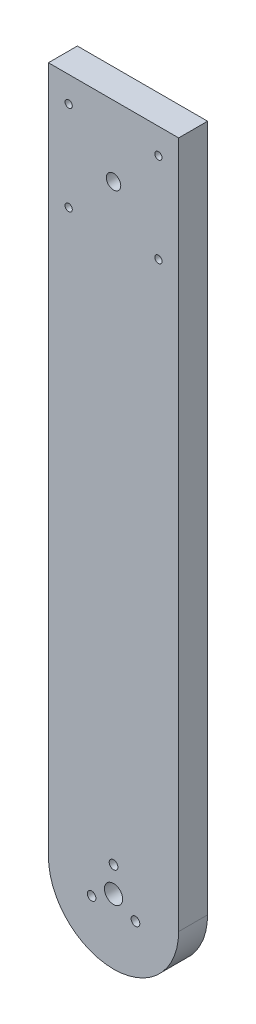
ISO-10303-21;
HEADER;
FILE_DESCRIPTION(('STEP AP214'),'2;1');
FILE_NAME('part.step','',(''),(''),'','','');
FILE_SCHEMA(('AUTOMOTIVE_DESIGN { 1 0 10303 214 1 1 1 1 }'));
ENDSEC;
DATA;
#1=APPLICATION_CONTEXT('core data for automotive mechanical design processes');
#2=APPLICATION_PROTOCOL_DEFINITION('international standard','automotive_design',2000,#1);
#3=PRODUCT_CONTEXT('',#1,'mechanical');
#4=PRODUCT('Part','Part','',(#3));
#5=PRODUCT_RELATED_PRODUCT_CATEGORY('part','',(#4));
#6=PRODUCT_DEFINITION_FORMATION('','',#4);
#7=PRODUCT_DEFINITION_CONTEXT('part definition',#1,'design');
#8=PRODUCT_DEFINITION('design','',#6,#7);
#9=PRODUCT_DEFINITION_SHAPE('','',#8);
#10=(LENGTH_UNIT() NAMED_UNIT(*) SI_UNIT(.MILLI.,.METRE.));
#11=(NAMED_UNIT(*) PLANE_ANGLE_UNIT() SI_UNIT($,.RADIAN.));
#12=(NAMED_UNIT(*) SI_UNIT($,.STERADIAN.) SOLID_ANGLE_UNIT());
#13=UNCERTAINTY_MEASURE_WITH_UNIT(LENGTH_MEASURE(1.E-05),#10,'distance_accuracy_value','');
#14=(GEOMETRIC_REPRESENTATION_CONTEXT(3) GLOBAL_UNCERTAINTY_ASSIGNED_CONTEXT((#13)) GLOBAL_UNIT_ASSIGNED_CONTEXT((#10,
#11,#12)) REPRESENTATION_CONTEXT('',''));
#15=CARTESIAN_POINT('',(0.,0.,0.));
#16=DIRECTION('',(0.,0.,1.));
#17=DIRECTION('',(1.,0.,0.));
#18=AXIS2_PLACEMENT_3D('',#15,#16,#17);
#19=CARTESIAN_POINT('',(5.46437894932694E-12,-107.5,10.));
#20=DIRECTION('',(0.,0.,1.));
#21=DIRECTION('',(1.,0.,0.));
#22=AXIS2_PLACEMENT_3D('',#19,#20,#21);
#23=PLANE('',#22);
#24=CARTESIAN_POINT('',(7.57772228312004,-111.875,10.));
#25=DIRECTION('',(0.,0.,1.));
#26=DIRECTION('',(1.,0.,0.));
#27=AXIS2_PLACEMENT_3D('',#24,#25,#26);
#28=CIRCLE('',#27,1.5);
#29=CARTESIAN_POINT('',(9.07772228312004,-111.875,10.));
#30=VERTEX_POINT('',#29);
#31=EDGE_CURVE('E151',#30,#30,#28,.T.);
#32=ORIENTED_EDGE('',*,*,#31,.F.);
#33=EDGE_LOOP('',(#32));
#34=FACE_BOUND('',#33,.T.);
#35=CARTESIAN_POINT('',(5.46437894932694E-12,-98.75,10.));
#36=DIRECTION('',(0.,0.,1.));
#37=DIRECTION('',(1.,0.,0.));
#38=AXIS2_PLACEMENT_3D('',#35,#36,#37);
#39=CIRCLE('',#38,1.5);
#40=CARTESIAN_POINT('',(1.50000000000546,-98.75,10.));
#41=VERTEX_POINT('',#40);
#42=EDGE_CURVE('E139',#41,#41,#39,.T.);
#43=ORIENTED_EDGE('',*,*,#42,.F.);
#44=EDGE_LOOP('',(#43));
#45=FACE_BOUND('',#44,.T.);
#46=CARTESIAN_POINT('',(-15.4999999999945,90.1639203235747,10.));
#47=DIRECTION('',(0.,0.,1.));
#48=DIRECTION('',(-1.,0.,0.));
#49=AXIS2_PLACEMENT_3D('',#46,#47,#48);
#50=CIRCLE('',#49,1.25);
#51=CARTESIAN_POINT('',(-16.7499999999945,90.1639203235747,10.));
#52=VERTEX_POINT('',#51);
#53=EDGE_CURVE('E127',#52,#52,#50,.T.);
#54=ORIENTED_EDGE('',*,*,#53,.F.);
#55=EDGE_LOOP('',(#54));
#56=FACE_BOUND('',#55,.T.);
#57=CARTESIAN_POINT('',(15.5000000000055,121.163920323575,10.));
#58=DIRECTION('',(0.,0.,1.));
#59=DIRECTION('',(-1.,0.,0.));
#60=AXIS2_PLACEMENT_3D('',#57,#58,#59);
#61=CIRCLE('',#60,1.25);
#62=CARTESIAN_POINT('',(14.2500000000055,121.163920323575,10.));
#63=VERTEX_POINT('',#62);
#64=EDGE_CURVE('E115',#63,#63,#61,.T.);
#65=ORIENTED_EDGE('',*,*,#64,.F.);
#66=EDGE_LOOP('',(#65));
#67=FACE_BOUND('',#66,.T.);
#68=DIRECTION('',(0.,-1.,0.));
#69=VECTOR('',#68,1.);
#70=CARTESIAN_POINT('',(-22.5,130.,10.));
#71=LINE('',#70,#69);
#72=CARTESIAN_POINT('',(-22.5,130.,10.));
#73=VERTEX_POINT('',#72);
#74=CARTESIAN_POINT('',(-22.4999999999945,-107.5,10.));
#75=VERTEX_POINT('',#74);
#76=EDGE_CURVE('E85',#73,#75,#71,.T.);
#77=ORIENTED_EDGE('',*,*,#76,.T.);
#78=CARTESIAN_POINT('',(5.46437894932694E-12,-107.5,10.));
#79=DIRECTION('',(0.,0.,1.));
#80=DIRECTION('',(1.,0.,0.));
#81=AXIS2_PLACEMENT_3D('',#78,#79,#80);
#82=CIRCLE('',#81,22.5);
#83=CARTESIAN_POINT('',(22.5,-107.5,10.));
#84=VERTEX_POINT('',#83);
#85=EDGE_CURVE('E80',#75,#84,#82,.T.);
#86=ORIENTED_EDGE('',*,*,#85,.T.);
#87=DIRECTION('',(0.,1.,0.));
#88=VECTOR('',#87,1.);
#89=CARTESIAN_POINT('',(22.5,130.,10.));
#90=LINE('',#89,#88);
#91=CARTESIAN_POINT('',(22.5,130.,10.));
#92=VERTEX_POINT('',#91);
#93=EDGE_CURVE('E83',#84,#92,#90,.T.);
#94=ORIENTED_EDGE('',*,*,#93,.T.);
#95=DIRECTION('',(-1.,0.,0.));
#96=VECTOR('',#95,1.);
#97=CARTESIAN_POINT('',(-22.5,130.,10.));
#98=LINE('',#97,#96);
#99=EDGE_CURVE('E50',#92,#73,#98,.T.);
#100=ORIENTED_EDGE('',*,*,#99,.T.);
#101=EDGE_LOOP('',(#77,#86,#94,#100));
#102=FACE_BOUND('',#101,.T.);
#103=CARTESIAN_POINT('',(-15.4999999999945,121.163920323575,10.));
#104=DIRECTION('',(0.,0.,1.));
#105=DIRECTION('',(1.,0.,0.));
#106=AXIS2_PLACEMENT_3D('',#103,#104,#105);
#107=CIRCLE('',#106,1.25);
#108=CARTESIAN_POINT('',(-14.2499999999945,121.163920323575,10.));
#109=VERTEX_POINT('',#108);
#110=EDGE_CURVE('E100',#109,#109,#107,.T.);
#111=ORIENTED_EDGE('',*,*,#110,.F.);
#112=EDGE_LOOP('',(#111));
#113=FACE_BOUND('',#112,.T.);
#114=CARTESIAN_POINT('',(15.5000000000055,90.1639203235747,10.));
#115=DIRECTION('',(0.,0.,1.));
#116=DIRECTION('',(1.,0.,0.));
#117=AXIS2_PLACEMENT_3D('',#114,#115,#116);
#118=CIRCLE('',#117,1.25);
#119=CARTESIAN_POINT('',(16.7500000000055,90.1639203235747,10.));
#120=VERTEX_POINT('',#119);
#121=EDGE_CURVE('E121',#120,#120,#118,.T.);
#122=ORIENTED_EDGE('',*,*,#121,.F.);
#123=EDGE_LOOP('',(#122));
#124=FACE_BOUND('',#123,.T.);
#125=CARTESIAN_POINT('',(5.4678483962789E-12,105.663920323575,10.));
#126=DIRECTION('',(0.,0.,1.));
#127=DIRECTION('',(1.,0.,0.));
#128=AXIS2_PLACEMENT_3D('',#125,#126,#127);
#129=CIRCLE('',#128,2.5);
#130=CARTESIAN_POINT('',(2.50000000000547,105.663920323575,10.));
#131=VERTEX_POINT('',#130);
#132=EDGE_CURVE('E133',#131,#131,#129,.T.);
#133=ORIENTED_EDGE('',*,*,#132,.F.);
#134=EDGE_LOOP('',(#133));
#135=FACE_BOUND('',#134,.T.);
#136=CARTESIAN_POINT('',(5.46437894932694E-12,-107.5,10.));
#137=DIRECTION('',(0.,0.,1.));
#138=DIRECTION('',(1.,0.,0.));
#139=AXIS2_PLACEMENT_3D('',#136,#137,#138);
#140=CIRCLE('',#139,3.15);
#141=CARTESIAN_POINT('',(3.15000000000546,-107.5,10.));
#142=VERTEX_POINT('',#141);
#143=EDGE_CURVE('E145',#142,#142,#140,.T.);
#144=ORIENTED_EDGE('',*,*,#143,.F.);
#145=EDGE_LOOP('',(#144));
#146=FACE_BOUND('',#145,.T.);
#147=CARTESIAN_POINT('',(-7.5777222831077,-111.875,10.));
#148=DIRECTION('',(0.,0.,1.));
#149=DIRECTION('',(1.,0.,0.));
#150=AXIS2_PLACEMENT_3D('',#147,#148,#149);
#151=CIRCLE('',#150,1.49999999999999);
#152=CARTESIAN_POINT('',(-6.07772228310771,-111.875,10.));
#153=VERTEX_POINT('',#152);
#154=EDGE_CURVE('E157',#153,#153,#151,.T.);
#155=ORIENTED_EDGE('',*,*,#154,.F.);
#156=EDGE_LOOP('',(#155));
#157=FACE_BOUND('',#156,.T.);
#158=ADVANCED_FACE('F33',(#34,#45,#56,#67,#102,#113,#124,#135,#146,#157),#23,.T.);
#159=CARTESIAN_POINT('',(5.46437894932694E-12,-107.5,0.));
#160=DIRECTION('',(0.,0.,1.));
#161=DIRECTION('',(1.,0.,0.));
#162=AXIS2_PLACEMENT_3D('',#159,#160,#161);
#163=PLANE('',#162);
#164=DIRECTION('',(0.,-1.,0.));
#165=VECTOR('',#164,1.);
#166=CARTESIAN_POINT('',(-22.5,130.,0.));
#167=LINE('',#166,#165);
#168=CARTESIAN_POINT('',(-22.5,130.,0.));
#169=VERTEX_POINT('',#168);
#170=CARTESIAN_POINT('',(-22.4999999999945,-107.5,0.));
#171=VERTEX_POINT('',#170);
#172=EDGE_CURVE('E97',#169,#171,#167,.T.);
#173=ORIENTED_EDGE('',*,*,#172,.F.);
#174=DIRECTION('',(-1.,0.,0.));
#175=VECTOR('',#174,1.);
#176=CARTESIAN_POINT('',(-22.5,130.,0.));
#177=LINE('',#176,#175);
#178=CARTESIAN_POINT('',(22.5,130.,0.));
#179=VERTEX_POINT('',#178);
#180=EDGE_CURVE('E73',#179,#169,#177,.T.);
#181=ORIENTED_EDGE('',*,*,#180,.F.);
#182=DIRECTION('',(0.,1.,0.));
#183=VECTOR('',#182,1.);
#184=CARTESIAN_POINT('',(22.5,130.,0.));
#185=LINE('',#184,#183);
#186=CARTESIAN_POINT('',(22.5,-107.5,0.));
#187=VERTEX_POINT('',#186);
#188=EDGE_CURVE('E67',#187,#179,#185,.T.);
#189=ORIENTED_EDGE('',*,*,#188,.F.);
#190=CARTESIAN_POINT('',(5.46437894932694E-12,-107.5,0.));
#191=DIRECTION('',(0.,0.,1.));
#192=DIRECTION('',(1.,0.,0.));
#193=AXIS2_PLACEMENT_3D('',#190,#191,#192);
#194=CIRCLE('',#193,22.5);
#195=EDGE_CURVE('E89',#171,#187,#194,.T.);
#196=ORIENTED_EDGE('',*,*,#195,.F.);
#197=EDGE_LOOP('',(#173,#181,#189,#196));
#198=FACE_BOUND('',#197,.T.);
#199=CARTESIAN_POINT('',(-15.4999999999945,121.163920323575,0.));
#200=DIRECTION('',(0.,0.,1.));
#201=DIRECTION('',(1.,0.,0.));
#202=AXIS2_PLACEMENT_3D('',#199,#200,#201);
#203=CIRCLE('',#202,1.25);
#204=CARTESIAN_POINT('',(-14.2499999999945,121.163920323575,0.));
#205=VERTEX_POINT('',#204);
#206=EDGE_CURVE('E112',#205,#205,#203,.T.);
#207=ORIENTED_EDGE('',*,*,#206,.T.);
#208=EDGE_LOOP('',(#207));
#209=FACE_BOUND('',#208,.T.);
#210=CARTESIAN_POINT('',(15.5000000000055,121.163920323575,0.));
#211=DIRECTION('',(0.,0.,1.));
#212=DIRECTION('',(-1.,0.,0.));
#213=AXIS2_PLACEMENT_3D('',#210,#211,#212);
#214=CIRCLE('',#213,1.25);
#215=CARTESIAN_POINT('',(14.2500000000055,121.163920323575,0.));
#216=VERTEX_POINT('',#215);
#217=EDGE_CURVE('E118',#216,#216,#214,.T.);
#218=ORIENTED_EDGE('',*,*,#217,.T.);
#219=EDGE_LOOP('',(#218));
#220=FACE_BOUND('',#219,.T.);
#221=CARTESIAN_POINT('',(15.5000000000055,90.1639203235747,0.));
#222=DIRECTION('',(0.,0.,1.));
#223=DIRECTION('',(1.,0.,0.));
#224=AXIS2_PLACEMENT_3D('',#221,#222,#223);
#225=CIRCLE('',#224,1.25);
#226=CARTESIAN_POINT('',(16.7500000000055,90.1639203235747,0.));
#227=VERTEX_POINT('',#226);
#228=EDGE_CURVE('E124',#227,#227,#225,.T.);
#229=ORIENTED_EDGE('',*,*,#228,.T.);
#230=EDGE_LOOP('',(#229));
#231=FACE_BOUND('',#230,.T.);
#232=CARTESIAN_POINT('',(-15.4999999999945,90.1639203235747,0.));
#233=DIRECTION('',(0.,0.,1.));
#234=DIRECTION('',(-1.,0.,0.));
#235=AXIS2_PLACEMENT_3D('',#232,#233,#234);
#236=CIRCLE('',#235,1.25);
#237=CARTESIAN_POINT('',(-16.7499999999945,90.1639203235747,0.));
#238=VERTEX_POINT('',#237);
#239=EDGE_CURVE('E130',#238,#238,#236,.T.);
#240=ORIENTED_EDGE('',*,*,#239,.T.);
#241=EDGE_LOOP('',(#240));
#242=FACE_BOUND('',#241,.T.);
#243=CARTESIAN_POINT('',(5.4678483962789E-12,105.663920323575,0.));
#244=DIRECTION('',(0.,0.,1.));
#245=DIRECTION('',(1.,0.,0.));
#246=AXIS2_PLACEMENT_3D('',#243,#244,#245);
#247=CIRCLE('',#246,2.5);
#248=CARTESIAN_POINT('',(2.50000000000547,105.663920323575,0.));
#249=VERTEX_POINT('',#248);
#250=EDGE_CURVE('E136',#249,#249,#247,.T.);
#251=ORIENTED_EDGE('',*,*,#250,.T.);
#252=EDGE_LOOP('',(#251));
#253=FACE_BOUND('',#252,.T.);
#254=CARTESIAN_POINT('',(5.46437894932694E-12,-98.75,0.));
#255=DIRECTION('',(0.,0.,1.));
#256=DIRECTION('',(1.,0.,0.));
#257=AXIS2_PLACEMENT_3D('',#254,#255,#256);
#258=CIRCLE('',#257,1.5);
#259=CARTESIAN_POINT('',(1.50000000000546,-98.75,0.));
#260=VERTEX_POINT('',#259);
#261=EDGE_CURVE('E142',#260,#260,#258,.T.);
#262=ORIENTED_EDGE('',*,*,#261,.T.);
#263=EDGE_LOOP('',(#262));
#264=FACE_BOUND('',#263,.T.);
#265=CARTESIAN_POINT('',(5.46437894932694E-12,-107.5,0.));
#266=DIRECTION('',(0.,0.,1.));
#267=DIRECTION('',(1.,0.,0.));
#268=AXIS2_PLACEMENT_3D('',#265,#266,#267);
#269=CIRCLE('',#268,3.15);
#270=CARTESIAN_POINT('',(3.15000000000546,-107.5,0.));
#271=VERTEX_POINT('',#270);
#272=EDGE_CURVE('E148',#271,#271,#269,.T.);
#273=ORIENTED_EDGE('',*,*,#272,.T.);
#274=EDGE_LOOP('',(#273));
#275=FACE_BOUND('',#274,.T.);
#276=CARTESIAN_POINT('',(7.57772228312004,-111.875,0.));
#277=DIRECTION('',(0.,0.,1.));
#278=DIRECTION('',(1.,0.,0.));
#279=AXIS2_PLACEMENT_3D('',#276,#277,#278);
#280=CIRCLE('',#279,1.5);
#281=CARTESIAN_POINT('',(9.07772228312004,-111.875,0.));
#282=VERTEX_POINT('',#281);
#283=EDGE_CURVE('E154',#282,#282,#280,.T.);
#284=ORIENTED_EDGE('',*,*,#283,.T.);
#285=EDGE_LOOP('',(#284));
#286=FACE_BOUND('',#285,.T.);
#287=CARTESIAN_POINT('',(-7.5777222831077,-111.875,0.));
#288=DIRECTION('',(0.,0.,1.));
#289=DIRECTION('',(1.,0.,0.));
#290=AXIS2_PLACEMENT_3D('',#287,#288,#289);
#291=CIRCLE('',#290,1.49999999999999);
#292=CARTESIAN_POINT('',(-6.07772228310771,-111.875,0.));
#293=VERTEX_POINT('',#292);
#294=EDGE_CURVE('E160',#293,#293,#291,.T.);
#295=ORIENTED_EDGE('',*,*,#294,.T.);
#296=EDGE_LOOP('',(#295));
#297=FACE_BOUND('',#296,.T.);
#298=ADVANCED_FACE('F108',(#198,#209,#220,#231,#242,#253,#264,#275,#286,#297),#163,.F.);
#299=CARTESIAN_POINT('',(-22.5,130.,10.));
#300=DIRECTION('',(1.,0.,0.));
#301=DIRECTION('',(0.,1.,0.));
#302=AXIS2_PLACEMENT_3D('',#299,#300,#301);
#303=PLANE('',#302);
#304=ORIENTED_EDGE('',*,*,#172,.T.);
#305=DIRECTION('',(0.,0.,-1.));
#306=VECTOR('',#305,1.);
#307=CARTESIAN_POINT('',(-22.4999999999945,-107.5,10.));
#308=LINE('',#307,#306);
#309=EDGE_CURVE('E11',#75,#171,#308,.T.);
#310=ORIENTED_EDGE('',*,*,#309,.F.);
#311=ORIENTED_EDGE('',*,*,#76,.F.);
#312=DIRECTION('',(0.,0.,-1.));
#313=VECTOR('',#312,1.);
#314=CARTESIAN_POINT('',(-22.5,130.,10.));
#315=LINE('',#314,#313);
#316=EDGE_CURVE('E93',#73,#169,#315,.T.);
#317=ORIENTED_EDGE('',*,*,#316,.T.);
#318=EDGE_LOOP('',(#304,#310,#311,#317));
#319=FACE_BOUND('',#318,.T.);
#320=ADVANCED_FACE('F35',(#319),#303,.F.);
#321=CARTESIAN_POINT('',(5.46437894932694E-12,-107.5,10.));
#322=DIRECTION('',(0.,0.,-1.));
#323=DIRECTION('',(-1.,0.,0.));
#324=AXIS2_PLACEMENT_3D('',#321,#322,#323);
#325=CYLINDRICAL_SURFACE('',#324,22.5);
#326=ORIENTED_EDGE('',*,*,#195,.T.);
#327=DIRECTION('',(0.,0.,-1.));
#328=VECTOR('',#327,1.);
#329=CARTESIAN_POINT('',(22.5,-107.5,10.));
#330=LINE('',#329,#328);
#331=EDGE_CURVE('E42',#84,#187,#330,.T.);
#332=ORIENTED_EDGE('',*,*,#331,.F.);
#333=ORIENTED_EDGE('',*,*,#85,.F.);
#334=ORIENTED_EDGE('',*,*,#309,.T.);
#335=EDGE_LOOP('',(#326,#332,#333,#334));
#336=FACE_BOUND('',#335,.T.);
#337=ADVANCED_FACE('F88',(#336),#325,.T.);
#338=CARTESIAN_POINT('',(22.5,130.,10.));
#339=DIRECTION('',(-1.,0.,0.));
#340=DIRECTION('',(0.,-1.,0.));
#341=AXIS2_PLACEMENT_3D('',#338,#339,#340);
#342=PLANE('',#341);
#343=ORIENTED_EDGE('',*,*,#188,.T.);
#344=DIRECTION('',(0.,0.,-1.));
#345=VECTOR('',#344,1.);
#346=CARTESIAN_POINT('',(22.5,130.,10.));
#347=LINE('',#346,#345);
#348=EDGE_CURVE('E90',#92,#179,#347,.T.);
#349=ORIENTED_EDGE('',*,*,#348,.F.);
#350=ORIENTED_EDGE('',*,*,#93,.F.);
#351=ORIENTED_EDGE('',*,*,#331,.T.);
#352=EDGE_LOOP('',(#343,#349,#350,#351));
#353=FACE_BOUND('',#352,.T.);
#354=ADVANCED_FACE('F91',(#353),#342,.F.);
#355=CARTESIAN_POINT('',(-22.5,130.,10.));
#356=DIRECTION('',(0.,-1.,0.));
#357=DIRECTION('',(0.,0.,-1.));
#358=AXIS2_PLACEMENT_3D('',#355,#356,#357);
#359=PLANE('',#358);
#360=ORIENTED_EDGE('',*,*,#180,.T.);
#361=ORIENTED_EDGE('',*,*,#316,.F.);
#362=ORIENTED_EDGE('',*,*,#99,.F.);
#363=ORIENTED_EDGE('',*,*,#348,.T.);
#364=EDGE_LOOP('',(#360,#361,#362,#363));
#365=FACE_BOUND('',#364,.T.);
#366=ADVANCED_FACE('F105',(#365),#359,.F.);
#367=CARTESIAN_POINT('',(-15.4999999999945,121.163920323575,10.));
#368=DIRECTION('',(0.,0.,-1.));
#369=DIRECTION('',(-1.,0.,0.));
#370=AXIS2_PLACEMENT_3D('',#367,#368,#369);
#371=CYLINDRICAL_SURFACE('',#370,1.25);
#372=ORIENTED_EDGE('',*,*,#110,.T.);
#373=EDGE_LOOP('',(#372));
#374=FACE_BOUND('',#373,.T.);
#375=ORIENTED_EDGE('',*,*,#206,.F.);
#376=EDGE_LOOP('',(#375));
#377=FACE_BOUND('',#376,.T.);
#378=ADVANCED_FACE('F179',(#374,#377),#371,.F.);
#379=CARTESIAN_POINT('',(15.5000000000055,121.163920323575,10.));
#380=DIRECTION('',(0.,0.,-1.));
#381=DIRECTION('',(-1.,0.,0.));
#382=AXIS2_PLACEMENT_3D('',#379,#380,#381);
#383=CYLINDRICAL_SURFACE('',#382,1.25);
#384=ORIENTED_EDGE('',*,*,#64,.T.);
#385=EDGE_LOOP('',(#384));
#386=FACE_BOUND('',#385,.T.);
#387=ORIENTED_EDGE('',*,*,#217,.F.);
#388=EDGE_LOOP('',(#387));
#389=FACE_BOUND('',#388,.T.);
#390=ADVANCED_FACE('F225',(#386,#389),#383,.F.);
#391=CARTESIAN_POINT('',(15.5000000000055,90.1639203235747,10.));
#392=DIRECTION('',(0.,0.,-1.));
#393=DIRECTION('',(-1.,0.,0.));
#394=AXIS2_PLACEMENT_3D('',#391,#392,#393);
#395=CYLINDRICAL_SURFACE('',#394,1.25);
#396=ORIENTED_EDGE('',*,*,#121,.T.);
#397=EDGE_LOOP('',(#396));
#398=FACE_BOUND('',#397,.T.);
#399=ORIENTED_EDGE('',*,*,#228,.F.);
#400=EDGE_LOOP('',(#399));
#401=FACE_BOUND('',#400,.T.);
#402=ADVANCED_FACE('F233',(#398,#401),#395,.F.);
#403=CARTESIAN_POINT('',(-15.4999999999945,90.1639203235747,10.));
#404=DIRECTION('',(0.,0.,-1.));
#405=DIRECTION('',(-1.,0.,0.));
#406=AXIS2_PLACEMENT_3D('',#403,#404,#405);
#407=CYLINDRICAL_SURFACE('',#406,1.25);
#408=ORIENTED_EDGE('',*,*,#53,.T.);
#409=EDGE_LOOP('',(#408));
#410=FACE_BOUND('',#409,.T.);
#411=ORIENTED_EDGE('',*,*,#239,.F.);
#412=EDGE_LOOP('',(#411));
#413=FACE_BOUND('',#412,.T.);
#414=ADVANCED_FACE('F241',(#410,#413),#407,.F.);
#415=CARTESIAN_POINT('',(5.4678483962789E-12,105.663920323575,10.));
#416=DIRECTION('',(0.,0.,-1.));
#417=DIRECTION('',(-1.,0.,0.));
#418=AXIS2_PLACEMENT_3D('',#415,#416,#417);
#419=CYLINDRICAL_SURFACE('',#418,2.5);
#420=ORIENTED_EDGE('',*,*,#132,.T.);
#421=EDGE_LOOP('',(#420));
#422=FACE_BOUND('',#421,.T.);
#423=ORIENTED_EDGE('',*,*,#250,.F.);
#424=EDGE_LOOP('',(#423));
#425=FACE_BOUND('',#424,.T.);
#426=ADVANCED_FACE('F250',(#422,#425),#419,.F.);
#427=CARTESIAN_POINT('',(5.46437894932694E-12,-98.75,10.));
#428=DIRECTION('',(0.,0.,-1.));
#429=DIRECTION('',(-1.,0.,0.));
#430=AXIS2_PLACEMENT_3D('',#427,#428,#429);
#431=CYLINDRICAL_SURFACE('',#430,1.5);
#432=ORIENTED_EDGE('',*,*,#42,.T.);
#433=EDGE_LOOP('',(#432));
#434=FACE_BOUND('',#433,.T.);
#435=ORIENTED_EDGE('',*,*,#261,.F.);
#436=EDGE_LOOP('',(#435));
#437=FACE_BOUND('',#436,.T.);
#438=ADVANCED_FACE('F259',(#434,#437),#431,.F.);
#439=CARTESIAN_POINT('',(5.46437894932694E-12,-107.5,10.));
#440=DIRECTION('',(0.,0.,-1.));
#441=DIRECTION('',(-1.,0.,0.));
#442=AXIS2_PLACEMENT_3D('',#439,#440,#441);
#443=CYLINDRICAL_SURFACE('',#442,3.15);
#444=ORIENTED_EDGE('',*,*,#143,.T.);
#445=EDGE_LOOP('',(#444));
#446=FACE_BOUND('',#445,.T.);
#447=ORIENTED_EDGE('',*,*,#272,.F.);
#448=EDGE_LOOP('',(#447));
#449=FACE_BOUND('',#448,.T.);
#450=ADVANCED_FACE('F268',(#446,#449),#443,.F.);
#451=CARTESIAN_POINT('',(7.57772228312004,-111.875,10.));
#452=DIRECTION('',(0.,0.,-1.));
#453=DIRECTION('',(-1.,0.,0.));
#454=AXIS2_PLACEMENT_3D('',#451,#452,#453);
#455=CYLINDRICAL_SURFACE('',#454,1.5);
#456=ORIENTED_EDGE('',*,*,#31,.T.);
#457=EDGE_LOOP('',(#456));
#458=FACE_BOUND('',#457,.T.);
#459=ORIENTED_EDGE('',*,*,#283,.F.);
#460=EDGE_LOOP('',(#459));
#461=FACE_BOUND('',#460,.T.);
#462=ADVANCED_FACE('F277',(#458,#461),#455,.F.);
#463=CARTESIAN_POINT('',(-7.5777222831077,-111.875,10.));
#464=DIRECTION('',(0.,0.,-1.));
#465=DIRECTION('',(-1.,0.,0.));
#466=AXIS2_PLACEMENT_3D('',#463,#464,#465);
#467=CYLINDRICAL_SURFACE('',#466,1.49999999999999);
#468=ORIENTED_EDGE('',*,*,#154,.T.);
#469=EDGE_LOOP('',(#468));
#470=FACE_BOUND('',#469,.T.);
#471=ORIENTED_EDGE('',*,*,#294,.F.);
#472=EDGE_LOOP('',(#471));
#473=FACE_BOUND('',#472,.T.);
#474=ADVANCED_FACE('F166',(#470,#473),#467,.F.);
#475=CLOSED_SHELL('',(#158,#298,#320,#337,#354,#366,#378,#390,#402,#414,#426,#438,#450,#462,#474));
#476=MANIFOLD_SOLID_BREP('B2',#475);
#477=ADVANCED_BREP_SHAPE_REPRESENTATION('',(#18,#476),#14);
#478=SHAPE_DEFINITION_REPRESENTATION(#9,#477);
ENDSEC;
END-ISO-10303-21;
